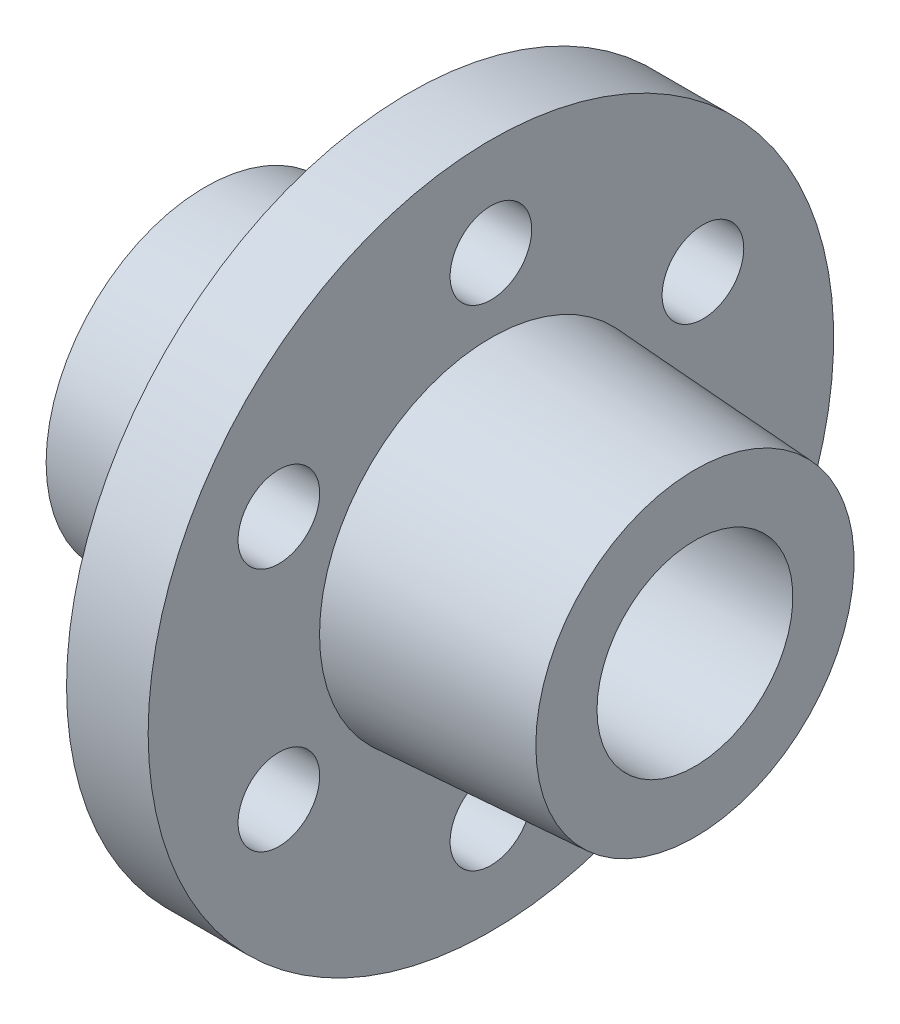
ISO-10303-21;
HEADER;
FILE_DESCRIPTION(('STEP AP214'),'2;1');
FILE_NAME('part.step','',(''),(''),'','','');
FILE_SCHEMA(('AUTOMOTIVE_DESIGN { 1 0 10303 214 1 1 1 1 }'));
ENDSEC;
DATA;
#1=APPLICATION_CONTEXT('core data for automotive mechanical design processes');
#2=APPLICATION_PROTOCOL_DEFINITION('international standard','automotive_design',2000,#1);
#3=PRODUCT_CONTEXT('',#1,'mechanical');
#4=PRODUCT('Part','Part','',(#3));
#5=PRODUCT_RELATED_PRODUCT_CATEGORY('part','',(#4));
#6=PRODUCT_DEFINITION_FORMATION('','',#4);
#7=PRODUCT_DEFINITION_CONTEXT('part definition',#1,'design');
#8=PRODUCT_DEFINITION('design','',#6,#7);
#9=PRODUCT_DEFINITION_SHAPE('','',#8);
#10=(LENGTH_UNIT() NAMED_UNIT(*) SI_UNIT(.MILLI.,.METRE.));
#11=(NAMED_UNIT(*) PLANE_ANGLE_UNIT() SI_UNIT($,.RADIAN.));
#12=(NAMED_UNIT(*) SI_UNIT($,.STERADIAN.) SOLID_ANGLE_UNIT());
#13=UNCERTAINTY_MEASURE_WITH_UNIT(LENGTH_MEASURE(1.E-05),#10,'distance_accuracy_value','');
#14=(GEOMETRIC_REPRESENTATION_CONTEXT(3) GLOBAL_UNCERTAINTY_ASSIGNED_CONTEXT((#13)) GLOBAL_UNIT_ASSIGNED_CONTEXT((#10,
#11,#12)) REPRESENTATION_CONTEXT('',''));
#15=CARTESIAN_POINT('',(0.,0.,0.));
#16=DIRECTION('',(0.,0.,1.));
#17=DIRECTION('',(1.,0.,0.));
#18=AXIS2_PLACEMENT_3D('',#15,#16,#17);
#19=CARTESIAN_POINT('',(30.,19.5,0.));
#20=DIRECTION('',(-1.,0.,0.));
#21=DIRECTION('',(0.,0.,1.));
#22=AXIS2_PLACEMENT_3D('',#19,#20,#21);
#23=PLANE('',#22);
#24=CARTESIAN_POINT('',(30.,0.,0.));
#25=DIRECTION('',(-1.,0.,0.));
#26=DIRECTION('',(0.,0.,1.));
#27=AXIS2_PLACEMENT_3D('',#24,#25,#26);
#28=CIRCLE('',#27,19.5);
#29=CARTESIAN_POINT('',(30.,0.,19.5));
#30=VERTEX_POINT('',#29);
#31=EDGE_CURVE('E58',#30,#30,#28,.T.);
#32=ORIENTED_EDGE('',*,*,#31,.F.);
#33=EDGE_LOOP('',(#32));
#34=FACE_BOUND('',#33,.T.);
#35=CARTESIAN_POINT('',(30.,0.,0.));
#36=DIRECTION('',(-1.,0.,0.));
#37=DIRECTION('',(0.,0.,1.));
#38=AXIS2_PLACEMENT_3D('',#35,#36,#37);
#39=CIRCLE('',#38,12.);
#40=CARTESIAN_POINT('',(30.,0.,12.));
#41=VERTEX_POINT('',#40);
#42=EDGE_CURVE('E10',#41,#41,#39,.T.);
#43=ORIENTED_EDGE('',*,*,#42,.T.);
#44=EDGE_LOOP('',(#43));
#45=FACE_BOUND('',#44,.T.);
#46=ADVANCED_FACE('F30',(#34,#45),#23,.F.);
#47=CARTESIAN_POINT('',(-30.,0.,0.));
#48=DIRECTION('',(-1.,0.,0.));
#49=DIRECTION('',(0.,0.,1.));
#50=AXIS2_PLACEMENT_3D('',#47,#48,#49);
#51=CYLINDRICAL_SURFACE('',#50,12.);
#52=ORIENTED_EDGE('',*,*,#42,.F.);
#53=EDGE_LOOP('',(#52));
#54=FACE_BOUND('',#53,.T.);
#55=CARTESIAN_POINT('',(-30.,0.,0.));
#56=DIRECTION('',(-1.,0.,0.));
#57=DIRECTION('',(0.,0.,1.));
#58=AXIS2_PLACEMENT_3D('',#55,#56,#57);
#59=CIRCLE('',#58,12.);
#60=CARTESIAN_POINT('',(-30.,0.,12.));
#61=VERTEX_POINT('',#60);
#62=EDGE_CURVE('E36',#61,#61,#59,.T.);
#63=ORIENTED_EDGE('',*,*,#62,.T.);
#64=EDGE_LOOP('',(#63));
#65=FACE_BOUND('',#64,.T.);
#66=ADVANCED_FACE('F128',(#54,#65),#51,.F.);
#67=CARTESIAN_POINT('',(-30.,19.5,0.));
#68=DIRECTION('',(1.,0.,0.));
#69=DIRECTION('',(0.,0.,-1.));
#70=AXIS2_PLACEMENT_3D('',#67,#68,#69);
#71=PLANE('',#70);
#72=ORIENTED_EDGE('',*,*,#62,.F.);
#73=EDGE_LOOP('',(#72));
#74=FACE_BOUND('',#73,.T.);
#75=CARTESIAN_POINT('',(-30.,0.,0.));
#76=DIRECTION('',(-1.,0.,0.));
#77=DIRECTION('',(0.,0.,1.));
#78=AXIS2_PLACEMENT_3D('',#75,#76,#77);
#79=CIRCLE('',#78,19.5);
#80=CARTESIAN_POINT('',(-30.,0.,19.5));
#81=VERTEX_POINT('',#80);
#82=EDGE_CURVE('E40',#81,#81,#79,.T.);
#83=ORIENTED_EDGE('',*,*,#82,.T.);
#84=EDGE_LOOP('',(#83));
#85=FACE_BOUND('',#84,.T.);
#86=ADVANCED_FACE('F132',(#74,#85),#71,.F.);
#87=CARTESIAN_POINT('',(-5.,0.,0.));
#88=DIRECTION('',(1.,0.,0.));
#89=DIRECTION('',(0.,0.,-1.));
#90=AXIS2_PLACEMENT_3D('',#87,#88,#89);
#91=CONICAL_SURFACE('',#90,21.,0.0599281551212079);
#92=ORIENTED_EDGE('',*,*,#82,.F.);
#93=EDGE_LOOP('',(#92));
#94=FACE_BOUND('',#93,.T.);
#95=CARTESIAN_POINT('',(-5.,0.,0.));
#96=DIRECTION('',(-1.,0.,0.));
#97=DIRECTION('',(0.,0.,1.));
#98=AXIS2_PLACEMENT_3D('',#95,#96,#97);
#99=CIRCLE('',#98,21.);
#100=CARTESIAN_POINT('',(-5.,0.,21.));
#101=VERTEX_POINT('',#100);
#102=EDGE_CURVE('E44',#101,#101,#99,.T.);
#103=ORIENTED_EDGE('',*,*,#102,.T.);
#104=EDGE_LOOP('',(#103));
#105=FACE_BOUND('',#104,.T.);
#106=ADVANCED_FACE('F137',(#94,#105),#91,.T.);
#107=CARTESIAN_POINT('',(-5.,42.,0.));
#108=DIRECTION('',(1.,0.,0.));
#109=DIRECTION('',(0.,0.,-1.));
#110=AXIS2_PLACEMENT_3D('',#107,#108,#109);
#111=PLANE('',#110);
#112=CARTESIAN_POINT('',(-5.,15.0000000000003,25.980762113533));
#113=DIRECTION('',(1.,0.,0.));
#114=DIRECTION('',(0.,0.,-1.));
#115=AXIS2_PLACEMENT_3D('',#112,#113,#114);
#116=CIRCLE('',#115,5.);
#117=CARTESIAN_POINT('',(-5.,15.0000000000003,20.980762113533));
#118=VERTEX_POINT('',#117);
#119=EDGE_CURVE('E91',#118,#118,#116,.T.);
#120=ORIENTED_EDGE('',*,*,#119,.T.);
#121=EDGE_LOOP('',(#120));
#122=FACE_BOUND('',#121,.T.);
#123=CARTESIAN_POINT('',(-5.,-14.9999999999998,25.9807621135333));
#124=DIRECTION('',(1.,0.,0.));
#125=DIRECTION('',(0.,0.,-1.));
#126=AXIS2_PLACEMENT_3D('',#123,#124,#125);
#127=CIRCLE('',#126,5.);
#128=CARTESIAN_POINT('',(-5.,-14.9999999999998,20.9807621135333));
#129=VERTEX_POINT('',#128);
#130=EDGE_CURVE('E85',#129,#129,#127,.T.);
#131=ORIENTED_EDGE('',*,*,#130,.T.);
#132=EDGE_LOOP('',(#131));
#133=FACE_BOUND('',#132,.T.);
#134=CARTESIAN_POINT('',(-5.,-30.,2.09489001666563E-13));
#135=DIRECTION('',(1.,0.,0.));
#136=DIRECTION('',(0.,0.,-1.));
#137=AXIS2_PLACEMENT_3D('',#134,#135,#136);
#138=CIRCLE('',#137,5.);
#139=CARTESIAN_POINT('',(-5.,-30.,-4.99999999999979));
#140=VERTEX_POINT('',#139);
#141=EDGE_CURVE('E79',#140,#140,#138,.T.);
#142=ORIENTED_EDGE('',*,*,#141,.T.);
#143=EDGE_LOOP('',(#142));
#144=FACE_BOUND('',#143,.T.);
#145=CARTESIAN_POINT('',(-5.,-15.0000000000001,-25.9807621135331));
#146=DIRECTION('',(1.,0.,0.));
#147=DIRECTION('',(0.,0.,-1.));
#148=AXIS2_PLACEMENT_3D('',#145,#146,#147);
#149=CIRCLE('',#148,5.);
#150=CARTESIAN_POINT('',(-5.,-15.0000000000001,-30.9807621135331));
#151=VERTEX_POINT('',#150);
#152=EDGE_CURVE('E73',#151,#151,#149,.T.);
#153=ORIENTED_EDGE('',*,*,#152,.T.);
#154=EDGE_LOOP('',(#153));
#155=FACE_BOUND('',#154,.T.);
#156=CARTESIAN_POINT('',(-5.,14.9999999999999,-25.9807621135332));
#157=DIRECTION('',(1.,0.,0.));
#158=DIRECTION('',(0.,0.,-1.));
#159=AXIS2_PLACEMENT_3D('',#156,#157,#158);
#160=CIRCLE('',#159,5.);
#161=CARTESIAN_POINT('',(-5.,14.9999999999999,-30.9807621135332));
#162=VERTEX_POINT('',#161);
#163=EDGE_CURVE('E67',#162,#162,#160,.T.);
#164=ORIENTED_EDGE('',*,*,#163,.T.);
#165=EDGE_LOOP('',(#164));
#166=FACE_BOUND('',#165,.T.);
#167=CARTESIAN_POINT('',(-5.,30.,0.));
#168=DIRECTION('',(1.,0.,0.));
#169=DIRECTION('',(0.,0.,-1.));
#170=AXIS2_PLACEMENT_3D('',#167,#168,#169);
#171=CIRCLE('',#170,5.);
#172=CARTESIAN_POINT('',(-5.,30.,-5.));
#173=VERTEX_POINT('',#172);
#174=EDGE_CURVE('E61',#173,#173,#171,.T.);
#175=ORIENTED_EDGE('',*,*,#174,.T.);
#176=EDGE_LOOP('',(#175));
#177=FACE_BOUND('',#176,.T.);
#178=ORIENTED_EDGE('',*,*,#102,.F.);
#179=EDGE_LOOP('',(#178));
#180=FACE_BOUND('',#179,.T.);
#181=CARTESIAN_POINT('',(-5.,0.,0.));
#182=DIRECTION('',(-1.,0.,0.));
#183=DIRECTION('',(0.,0.,1.));
#184=AXIS2_PLACEMENT_3D('',#181,#182,#183);
#185=CIRCLE('',#184,42.);
#186=CARTESIAN_POINT('',(-5.,0.,42.));
#187=VERTEX_POINT('',#186);
#188=EDGE_CURVE('E49',#187,#187,#185,.T.);
#189=ORIENTED_EDGE('',*,*,#188,.T.);
#190=EDGE_LOOP('',(#189));
#191=FACE_BOUND('',#190,.T.);
#192=ADVANCED_FACE('F143',(#122,#133,#144,#155,#166,#177,#180,#191),#111,.F.);
#193=CARTESIAN_POINT('',(-30.,0.,0.));
#194=DIRECTION('',(-1.,0.,0.));
#195=DIRECTION('',(0.,0.,1.));
#196=AXIS2_PLACEMENT_3D('',#193,#194,#195);
#197=CYLINDRICAL_SURFACE('',#196,42.);
#198=ORIENTED_EDGE('',*,*,#188,.F.);
#199=EDGE_LOOP('',(#198));
#200=FACE_BOUND('',#199,.T.);
#201=CARTESIAN_POINT('',(5.,0.,0.));
#202=DIRECTION('',(-1.,0.,0.));
#203=DIRECTION('',(0.,0.,1.));
#204=AXIS2_PLACEMENT_3D('',#201,#202,#203);
#205=CIRCLE('',#204,42.);
#206=CARTESIAN_POINT('',(5.,0.,42.));
#207=VERTEX_POINT('',#206);
#208=EDGE_CURVE('E52',#207,#207,#205,.T.);
#209=ORIENTED_EDGE('',*,*,#208,.T.);
#210=EDGE_LOOP('',(#209));
#211=FACE_BOUND('',#210,.T.);
#212=ADVANCED_FACE('F105',(#200,#211),#197,.T.);
#213=CARTESIAN_POINT('',(5.,42.,0.));
#214=DIRECTION('',(-1.,0.,0.));
#215=DIRECTION('',(0.,0.,1.));
#216=AXIS2_PLACEMENT_3D('',#213,#214,#215);
#217=PLANE('',#216);
#218=CARTESIAN_POINT('',(5.,15.0000000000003,25.980762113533));
#219=DIRECTION('',(1.,0.,0.));
#220=DIRECTION('',(0.,0.,-1.));
#221=AXIS2_PLACEMENT_3D('',#218,#219,#220);
#222=CIRCLE('',#221,5.);
#223=CARTESIAN_POINT('',(5.,15.0000000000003,20.980762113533));
#224=VERTEX_POINT('',#223);
#225=EDGE_CURVE('E94',#224,#224,#222,.T.);
#226=ORIENTED_EDGE('',*,*,#225,.F.);
#227=EDGE_LOOP('',(#226));
#228=FACE_BOUND('',#227,.T.);
#229=CARTESIAN_POINT('',(5.,-14.9999999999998,25.9807621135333));
#230=DIRECTION('',(1.,0.,0.));
#231=DIRECTION('',(0.,0.,-1.));
#232=AXIS2_PLACEMENT_3D('',#229,#230,#231);
#233=CIRCLE('',#232,5.);
#234=CARTESIAN_POINT('',(5.,-14.9999999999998,20.9807621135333));
#235=VERTEX_POINT('',#234);
#236=EDGE_CURVE('E88',#235,#235,#233,.T.);
#237=ORIENTED_EDGE('',*,*,#236,.F.);
#238=EDGE_LOOP('',(#237));
#239=FACE_BOUND('',#238,.T.);
#240=CARTESIAN_POINT('',(5.,-30.,2.09489001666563E-13));
#241=DIRECTION('',(1.,0.,0.));
#242=DIRECTION('',(0.,0.,-1.));
#243=AXIS2_PLACEMENT_3D('',#240,#241,#242);
#244=CIRCLE('',#243,5.);
#245=CARTESIAN_POINT('',(5.,-30.,-4.99999999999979));
#246=VERTEX_POINT('',#245);
#247=EDGE_CURVE('E82',#246,#246,#244,.T.);
#248=ORIENTED_EDGE('',*,*,#247,.F.);
#249=EDGE_LOOP('',(#248));
#250=FACE_BOUND('',#249,.T.);
#251=CARTESIAN_POINT('',(5.,-15.0000000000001,-25.9807621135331));
#252=DIRECTION('',(1.,0.,0.));
#253=DIRECTION('',(0.,0.,-1.));
#254=AXIS2_PLACEMENT_3D('',#251,#252,#253);
#255=CIRCLE('',#254,5.);
#256=CARTESIAN_POINT('',(5.,-15.0000000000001,-30.9807621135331));
#257=VERTEX_POINT('',#256);
#258=EDGE_CURVE('E76',#257,#257,#255,.T.);
#259=ORIENTED_EDGE('',*,*,#258,.F.);
#260=EDGE_LOOP('',(#259));
#261=FACE_BOUND('',#260,.T.);
#262=CARTESIAN_POINT('',(5.,14.9999999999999,-25.9807621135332));
#263=DIRECTION('',(1.,0.,0.));
#264=DIRECTION('',(0.,0.,-1.));
#265=AXIS2_PLACEMENT_3D('',#262,#263,#264);
#266=CIRCLE('',#265,5.);
#267=CARTESIAN_POINT('',(5.,14.9999999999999,-30.9807621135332));
#268=VERTEX_POINT('',#267);
#269=EDGE_CURVE('E70',#268,#268,#266,.T.);
#270=ORIENTED_EDGE('',*,*,#269,.F.);
#271=EDGE_LOOP('',(#270));
#272=FACE_BOUND('',#271,.T.);
#273=CARTESIAN_POINT('',(5.,30.,0.));
#274=DIRECTION('',(1.,0.,0.));
#275=DIRECTION('',(0.,0.,-1.));
#276=AXIS2_PLACEMENT_3D('',#273,#274,#275);
#277=CIRCLE('',#276,5.);
#278=CARTESIAN_POINT('',(5.,30.,-5.));
#279=VERTEX_POINT('',#278);
#280=EDGE_CURVE('E64',#279,#279,#277,.T.);
#281=ORIENTED_EDGE('',*,*,#280,.F.);
#282=EDGE_LOOP('',(#281));
#283=FACE_BOUND('',#282,.T.);
#284=ORIENTED_EDGE('',*,*,#208,.F.);
#285=EDGE_LOOP('',(#284));
#286=FACE_BOUND('',#285,.T.);
#287=CARTESIAN_POINT('',(5.,0.,0.));
#288=DIRECTION('',(-1.,0.,0.));
#289=DIRECTION('',(0.,0.,1.));
#290=AXIS2_PLACEMENT_3D('',#287,#288,#289);
#291=CIRCLE('',#290,21.);
#292=CARTESIAN_POINT('',(5.,0.,21.));
#293=VERTEX_POINT('',#292);
#294=EDGE_CURVE('E55',#293,#293,#291,.T.);
#295=ORIENTED_EDGE('',*,*,#294,.T.);
#296=EDGE_LOOP('',(#295));
#297=FACE_BOUND('',#296,.T.);
#298=ADVANCED_FACE('F101',(#228,#239,#250,#261,#272,#283,#286,#297),#217,.F.);
#299=CARTESIAN_POINT('',(30.,0.,0.));
#300=DIRECTION('',(-1.,0.,0.));
#301=DIRECTION('',(0.,0.,1.));
#302=AXIS2_PLACEMENT_3D('',#299,#300,#301);
#303=CONICAL_SURFACE('',#302,19.5,0.0599281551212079);
#304=ORIENTED_EDGE('',*,*,#294,.F.);
#305=EDGE_LOOP('',(#304));
#306=FACE_BOUND('',#305,.T.);
#307=ORIENTED_EDGE('',*,*,#31,.T.);
#308=EDGE_LOOP('',(#307));
#309=FACE_BOUND('',#308,.T.);
#310=ADVANCED_FACE('F104',(#306,#309),#303,.T.);
#311=CARTESIAN_POINT('',(-30.,30.,0.));
#312=DIRECTION('',(1.,0.,0.));
#313=DIRECTION('',(0.,0.,-1.));
#314=AXIS2_PLACEMENT_3D('',#311,#312,#313);
#315=CYLINDRICAL_SURFACE('',#314,5.);
#316=ORIENTED_EDGE('',*,*,#280,.T.);
#317=EDGE_LOOP('',(#316));
#318=FACE_BOUND('',#317,.T.);
#319=ORIENTED_EDGE('',*,*,#174,.F.);
#320=EDGE_LOOP('',(#319));
#321=FACE_BOUND('',#320,.T.);
#322=ADVANCED_FACE('F123',(#318,#321),#315,.F.);
#323=CARTESIAN_POINT('',(-30.,14.9999999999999,-25.9807621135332));
#324=DIRECTION('',(1.,0.,0.));
#325=DIRECTION('',(0.,0.,-1.));
#326=AXIS2_PLACEMENT_3D('',#323,#324,#325);
#327=CYLINDRICAL_SURFACE('',#326,5.);
#328=ORIENTED_EDGE('',*,*,#269,.T.);
#329=EDGE_LOOP('',(#328));
#330=FACE_BOUND('',#329,.T.);
#331=ORIENTED_EDGE('',*,*,#163,.F.);
#332=EDGE_LOOP('',(#331));
#333=FACE_BOUND('',#332,.T.);
#334=ADVANCED_FACE('F153',(#330,#333),#327,.F.);
#335=CARTESIAN_POINT('',(-30.,-15.0000000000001,-25.9807621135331));
#336=DIRECTION('',(1.,0.,0.));
#337=DIRECTION('',(0.,0.,-1.));
#338=AXIS2_PLACEMENT_3D('',#335,#336,#337);
#339=CYLINDRICAL_SURFACE('',#338,5.);
#340=ORIENTED_EDGE('',*,*,#258,.T.);
#341=EDGE_LOOP('',(#340));
#342=FACE_BOUND('',#341,.T.);
#343=ORIENTED_EDGE('',*,*,#152,.F.);
#344=EDGE_LOOP('',(#343));
#345=FACE_BOUND('',#344,.T.);
#346=ADVANCED_FACE('F157',(#342,#345),#339,.F.);
#347=CARTESIAN_POINT('',(-30.,-30.,2.09489001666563E-13));
#348=DIRECTION('',(1.,0.,0.));
#349=DIRECTION('',(0.,0.,-1.));
#350=AXIS2_PLACEMENT_3D('',#347,#348,#349);
#351=CYLINDRICAL_SURFACE('',#350,5.);
#352=ORIENTED_EDGE('',*,*,#247,.T.);
#353=EDGE_LOOP('',(#352));
#354=FACE_BOUND('',#353,.T.);
#355=ORIENTED_EDGE('',*,*,#141,.F.);
#356=EDGE_LOOP('',(#355));
#357=FACE_BOUND('',#356,.T.);
#358=ADVANCED_FACE('F161',(#354,#357),#351,.F.);
#359=CARTESIAN_POINT('',(-30.,-14.9999999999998,25.9807621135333));
#360=DIRECTION('',(1.,0.,0.));
#361=DIRECTION('',(0.,0.,-1.));
#362=AXIS2_PLACEMENT_3D('',#359,#360,#361);
#363=CYLINDRICAL_SURFACE('',#362,5.);
#364=ORIENTED_EDGE('',*,*,#236,.T.);
#365=EDGE_LOOP('',(#364));
#366=FACE_BOUND('',#365,.T.);
#367=ORIENTED_EDGE('',*,*,#130,.F.);
#368=EDGE_LOOP('',(#367));
#369=FACE_BOUND('',#368,.T.);
#370=ADVANCED_FACE('F165',(#366,#369),#363,.F.);
#371=CARTESIAN_POINT('',(-30.,15.0000000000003,25.980762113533));
#372=DIRECTION('',(1.,0.,0.));
#373=DIRECTION('',(0.,0.,-1.));
#374=AXIS2_PLACEMENT_3D('',#371,#372,#373);
#375=CYLINDRICAL_SURFACE('',#374,5.);
#376=ORIENTED_EDGE('',*,*,#225,.T.);
#377=EDGE_LOOP('',(#376));
#378=FACE_BOUND('',#377,.T.);
#379=ORIENTED_EDGE('',*,*,#119,.F.);
#380=EDGE_LOOP('',(#379));
#381=FACE_BOUND('',#380,.T.);
#382=ADVANCED_FACE('F98',(#378,#381),#375,.F.);
#383=CLOSED_SHELL('',(#46,#66,#86,#106,#192,#212,#298,#310,#322,#334,#346,#358,#370,#382));
#384=MANIFOLD_SOLID_BREP('B2',#383);
#385=ADVANCED_BREP_SHAPE_REPRESENTATION('',(#18,#384),#14);
#386=SHAPE_DEFINITION_REPRESENTATION(#9,#385);
ENDSEC;
END-ISO-10303-21;
